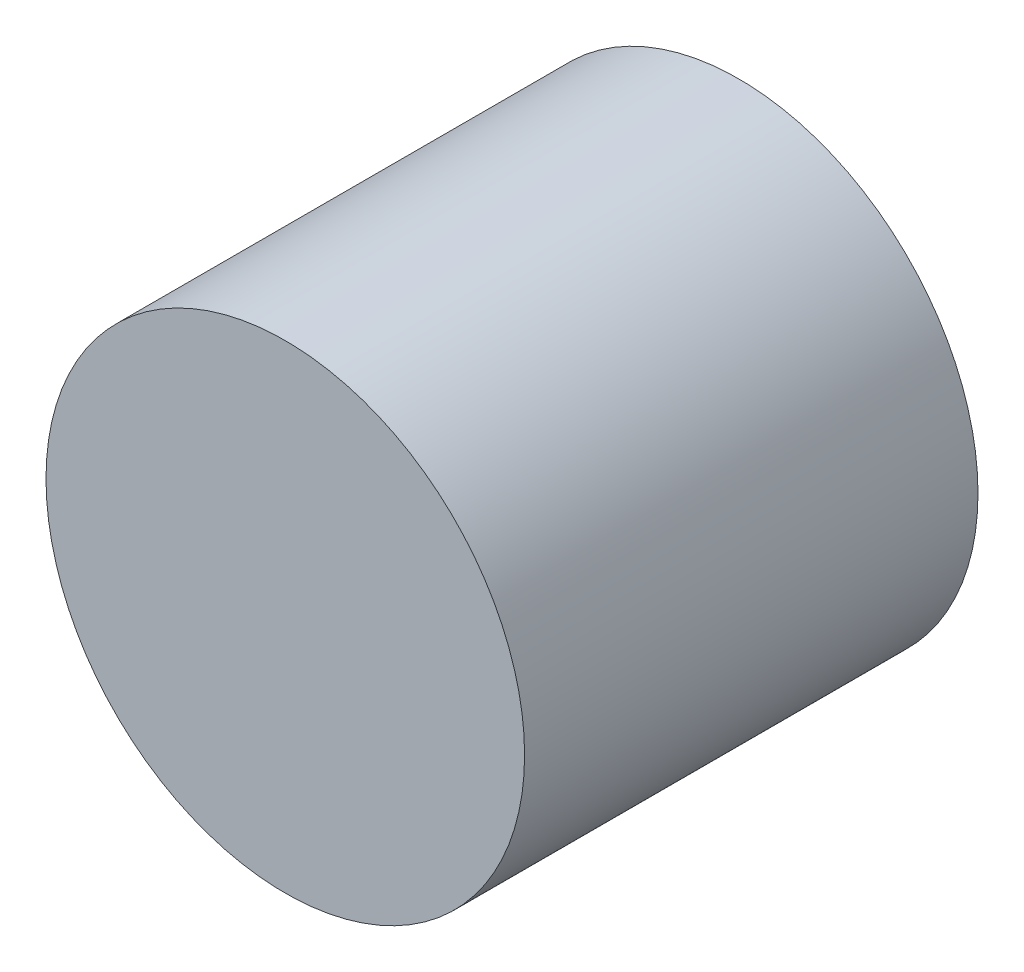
ISO-10303-21;
HEADER;
FILE_DESCRIPTION(('STEP AP214'),'2;1');
FILE_NAME('part.step','',(''),(''),'','','');
FILE_SCHEMA(('AUTOMOTIVE_DESIGN { 1 0 10303 214 1 1 1 1 }'));
ENDSEC;
DATA;
#1=APPLICATION_CONTEXT('core data for automotive mechanical design processes');
#2=APPLICATION_PROTOCOL_DEFINITION('international standard','automotive_design',2000,#1);
#3=PRODUCT_CONTEXT('',#1,'mechanical');
#4=PRODUCT('Part','Part','',(#3));
#5=PRODUCT_RELATED_PRODUCT_CATEGORY('part','',(#4));
#6=PRODUCT_DEFINITION_FORMATION('','',#4);
#7=PRODUCT_DEFINITION_CONTEXT('part definition',#1,'design');
#8=PRODUCT_DEFINITION('design','',#6,#7);
#9=PRODUCT_DEFINITION_SHAPE('','',#8);
#10=(LENGTH_UNIT() NAMED_UNIT(*) SI_UNIT(.MILLI.,.METRE.));
#11=(NAMED_UNIT(*) PLANE_ANGLE_UNIT() SI_UNIT($,.RADIAN.));
#12=(NAMED_UNIT(*) SI_UNIT($,.STERADIAN.) SOLID_ANGLE_UNIT());
#13=UNCERTAINTY_MEASURE_WITH_UNIT(LENGTH_MEASURE(1.E-05),#10,'distance_accuracy_value','');
#14=(GEOMETRIC_REPRESENTATION_CONTEXT(3) GLOBAL_UNCERTAINTY_ASSIGNED_CONTEXT((#13)) GLOBAL_UNIT_ASSIGNED_CONTEXT((#10,
#11,#12)) REPRESENTATION_CONTEXT('',''));
#15=CARTESIAN_POINT('',(0.,0.,0.));
#16=DIRECTION('',(0.,0.,1.));
#17=DIRECTION('',(1.,0.,0.));
#18=AXIS2_PLACEMENT_3D('',#15,#16,#17);
#19=CARTESIAN_POINT('',(0.,0.,72.));
#20=DIRECTION('',(0.,0.,-1.));
#21=DIRECTION('',(-1.,0.,0.));
#22=AXIS2_PLACEMENT_3D('',#19,#20,#21);
#23=CYLINDRICAL_SURFACE('',#22,57.);
#24=CARTESIAN_POINT('',(0.,0.,72.));
#25=DIRECTION('',(0.,0.,1.));
#26=DIRECTION('',(1.,0.,0.));
#27=AXIS2_PLACEMENT_3D('',#24,#25,#26);
#28=CIRCLE('',#27,57.);
#29=CARTESIAN_POINT('',(57.,0.,72.));
#30=VERTEX_POINT('',#29);
#31=EDGE_CURVE('E10',#30,#30,#28,.T.);
#32=ORIENTED_EDGE('',*,*,#31,.F.);
#33=EDGE_LOOP('',(#32));
#34=FACE_BOUND('',#33,.T.);
#35=CARTESIAN_POINT('',(0.,0.,-36.));
#36=DIRECTION('',(0.,0.,1.));
#37=DIRECTION('',(1.,0.,0.));
#38=AXIS2_PLACEMENT_3D('',#35,#36,#37);
#39=CIRCLE('',#38,57.);
#40=CARTESIAN_POINT('',(57.,0.,-36.));
#41=VERTEX_POINT('',#40);
#42=EDGE_CURVE('E36',#41,#41,#39,.T.);
#43=ORIENTED_EDGE('',*,*,#42,.T.);
#44=EDGE_LOOP('',(#43));
#45=FACE_BOUND('',#44,.T.);
#46=ADVANCED_FACE('F30',(#34,#45),#23,.T.);
#47=CARTESIAN_POINT('',(0.,0.,72.));
#48=DIRECTION('',(0.,0.,1.));
#49=DIRECTION('',(1.,0.,0.));
#50=AXIS2_PLACEMENT_3D('',#47,#48,#49);
#51=PLANE('',#50);
#52=ORIENTED_EDGE('',*,*,#31,.T.);
#53=EDGE_LOOP('',(#52));
#54=FACE_BOUND('',#53,.T.);
#55=ADVANCED_FACE('F45',(#54),#51,.T.);
#56=CARTESIAN_POINT('',(0.,0.,-36.));
#57=DIRECTION('',(0.,0.,1.));
#58=DIRECTION('',(1.,0.,0.));
#59=AXIS2_PLACEMENT_3D('',#56,#57,#58);
#60=PLANE('',#59);
#61=ORIENTED_EDGE('',*,*,#42,.F.);
#62=EDGE_LOOP('',(#61));
#63=FACE_BOUND('',#62,.T.);
#64=ADVANCED_FACE('F43',(#63),#60,.F.);
#65=CLOSED_SHELL('',(#46,#55,#64));
#66=MANIFOLD_SOLID_BREP('B2',#65);
#67=ADVANCED_BREP_SHAPE_REPRESENTATION('',(#18,#66),#14);
#68=SHAPE_DEFINITION_REPRESENTATION(#9,#67);
ENDSEC;
END-ISO-10303-21;
